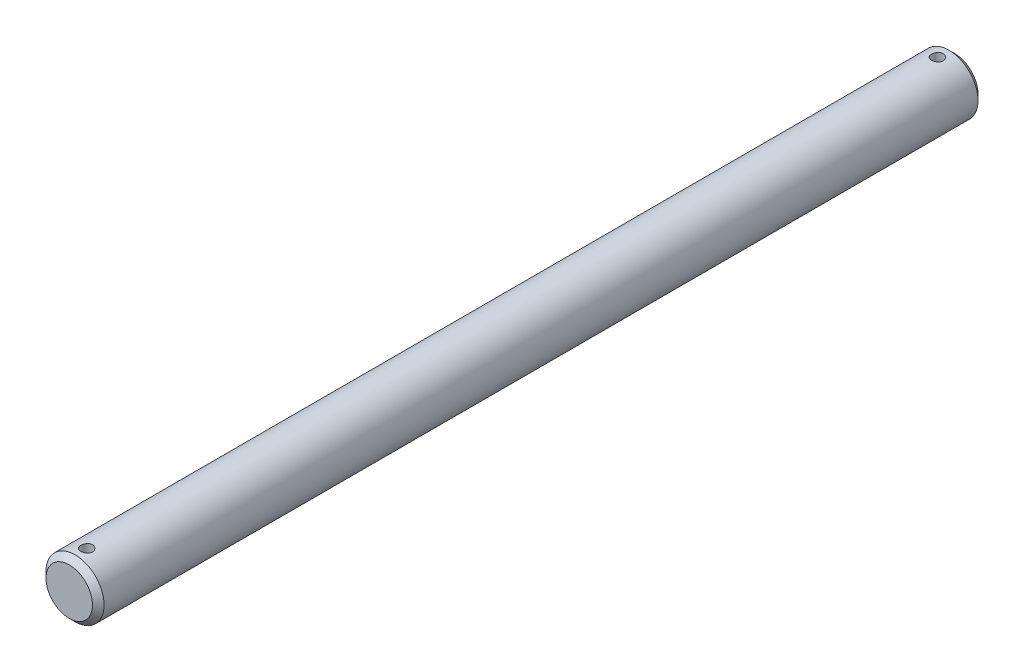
ISO-10303-21;
HEADER;
FILE_DESCRIPTION(('STEP AP214'),'2;1');
FILE_NAME('part.step','',(''),(''),'','','');
FILE_SCHEMA(('AUTOMOTIVE_DESIGN { 1 0 10303 214 1 1 1 1 }'));
ENDSEC;
DATA;
#1=APPLICATION_CONTEXT('core data for automotive mechanical design processes');
#2=APPLICATION_PROTOCOL_DEFINITION('international standard','automotive_design',2000,#1);
#3=PRODUCT_CONTEXT('',#1,'mechanical');
#4=PRODUCT('Part','Part','',(#3));
#5=PRODUCT_RELATED_PRODUCT_CATEGORY('part','',(#4));
#6=PRODUCT_DEFINITION_FORMATION('','',#4);
#7=PRODUCT_DEFINITION_CONTEXT('part definition',#1,'design');
#8=PRODUCT_DEFINITION('design','',#6,#7);
#9=PRODUCT_DEFINITION_SHAPE('','',#8);
#10=(LENGTH_UNIT() NAMED_UNIT(*) SI_UNIT(.MILLI.,.METRE.));
#11=(NAMED_UNIT(*) PLANE_ANGLE_UNIT() SI_UNIT($,.RADIAN.));
#12=(NAMED_UNIT(*) SI_UNIT($,.STERADIAN.) SOLID_ANGLE_UNIT());
#13=UNCERTAINTY_MEASURE_WITH_UNIT(LENGTH_MEASURE(1.E-05),#10,'distance_accuracy_value','');
#14=(GEOMETRIC_REPRESENTATION_CONTEXT(3) GLOBAL_UNCERTAINTY_ASSIGNED_CONTEXT((#13)) GLOBAL_UNIT_ASSIGNED_CONTEXT((#10,
#11,#12)) REPRESENTATION_CONTEXT('',''));
#15=CARTESIAN_POINT('',(0.,0.,0.));
#16=DIRECTION('',(0.,0.,1.));
#17=DIRECTION('',(1.,0.,0.));
#18=AXIS2_PLACEMENT_3D('',#15,#16,#17);
#19=CARTESIAN_POINT('',(0.,0.,305.));
#20=DIRECTION('',(0.,0.,-1.));
#21=DIRECTION('',(-1.,0.,0.));
#22=AXIS2_PLACEMENT_3D('',#19,#20,#21);
#23=CYLINDRICAL_SURFACE('',#22,10.);
#24=CARTESIAN_POINT('',(0.,0.,303.));
#25=DIRECTION('',(0.,0.,1.));
#26=DIRECTION('',(1.,0.,0.));
#27=AXIS2_PLACEMENT_3D('',#24,#25,#26);
#28=CIRCLE('',#27,10.);
#29=CARTESIAN_POINT('',(10.,0.,303.));
#30=VERTEX_POINT('',#29);
#31=EDGE_CURVE('E38',#30,#30,#28,.F.);
#32=ORIENTED_EDGE('',*,*,#31,.T.);
#33=EDGE_LOOP('',(#32));
#34=FACE_BOUND('',#33,.T.);
#35=CARTESIAN_POINT('',(0.,0.,2.));
#36=DIRECTION('',(0.,0.,1.));
#37=DIRECTION('',(1.,0.,0.));
#38=AXIS2_PLACEMENT_3D('',#35,#36,#37);
#39=CIRCLE('',#38,10.);
#40=CARTESIAN_POINT('',(10.,0.,2.));
#41=VERTEX_POINT('',#40);
#42=EDGE_CURVE('E44',#41,#41,#39,.T.);
#43=ORIENTED_EDGE('',*,*,#42,.T.);
#44=EDGE_LOOP('',(#43));
#45=FACE_BOUND('',#44,.T.);
#46=CARTESIAN_POINT('',(0.,-10.,297.));
#47=CARTESIAN_POINT('',(0.111153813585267,-9.99999795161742,297.000004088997));
#48=CARTESIAN_POINT('',(0.222359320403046,-9.99812770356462,297.009297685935));
#49=CARTESIAN_POINT('',(0.441627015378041,-9.99084731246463,297.046197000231));
#50=CARTESIAN_POINT('',(0.549686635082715,-9.98543435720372,297.073817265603));
#51=CARTESIAN_POINT('',(0.759460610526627,-9.97167298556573,297.146482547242));
#52=CARTESIAN_POINT('',(0.861180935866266,-9.96332738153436,297.191510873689));
#53=CARTESIAN_POINT('',(1.05561597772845,-9.94460796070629,297.297664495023));
#54=CARTESIAN_POINT('',(1.14833123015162,-9.93423426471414,297.358788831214));
#55=CARTESIAN_POINT('',(1.32338695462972,-9.9124433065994,297.496276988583));
#56=CARTESIAN_POINT('',(1.40558790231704,-9.90101491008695,297.572816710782));
#57=CARTESIAN_POINT('',(1.55607351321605,-9.87848360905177,297.738584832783));
#58=CARTESIAN_POINT('',(1.62435708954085,-9.86738073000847,297.82781422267));
#59=CARTESIAN_POINT('',(1.74566350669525,-9.8466488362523,298.017432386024));
#60=CARTESIAN_POINT('',(1.79854187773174,-9.83703414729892,298.117915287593));
#61=CARTESIAN_POINT('',(1.88661133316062,-9.82052536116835,298.326563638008));
#62=CARTESIAN_POINT('',(1.92180416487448,-9.81363099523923,298.434728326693));
#63=CARTESIAN_POINT('',(1.97305059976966,-9.80345610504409,298.654168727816));
#64=CARTESIAN_POINT('',(1.98934899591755,-9.80012940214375,298.765385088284));
#65=CARTESIAN_POINT('',(2.00310425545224,-9.79732750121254,298.989019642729));
#66=CARTESIAN_POINT('',(2.000563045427,-9.79785190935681,299.10143771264));
#67=CARTESIAN_POINT('',(1.97690914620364,-9.80265102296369,299.322493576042));
#68=CARTESIAN_POINT('',(1.95607708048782,-9.80686905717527,299.431162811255));
#69=CARTESIAN_POINT('',(1.8968757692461,-9.81849092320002,299.643432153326));
#70=CARTESIAN_POINT('',(1.85850568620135,-9.82589490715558,299.747032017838));
#71=CARTESIAN_POINT('',(1.76504956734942,-9.84311237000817,299.947030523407));
#72=CARTESIAN_POINT('',(1.7098523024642,-9.85294179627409,300.043375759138));
#73=CARTESIAN_POINT('',(1.58438714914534,-9.87389237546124,300.225541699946));
#74=CARTESIAN_POINT('',(1.51411752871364,-9.88501367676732,300.311361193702));
#75=CARTESIAN_POINT('',(1.35899986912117,-9.90754042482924,300.471658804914));
#76=CARTESIAN_POINT('',(1.27391232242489,-9.91894738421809,300.545905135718));
#77=CARTESIAN_POINT('',(1.09237004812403,-9.94057697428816,300.679107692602));
#78=CARTESIAN_POINT('',(0.995915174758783,-9.95079958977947,300.738063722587));
#79=CARTESIAN_POINT('',(0.794118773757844,-9.96893380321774,300.839055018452));
#80=CARTESIAN_POINT('',(0.688763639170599,-9.97684177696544,300.881063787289));
#81=CARTESIAN_POINT('',(0.472297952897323,-9.98942817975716,300.946720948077));
#82=CARTESIAN_POINT('',(0.36118810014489,-9.99410700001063,300.970371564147));
#83=CARTESIAN_POINT('',(0.138358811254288,-9.99965343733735,300.998312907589));
#84=CARTESIAN_POINT('',(0.0266806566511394,-10.0005834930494,301.002920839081));
#85=CARTESIAN_POINT('',(-0.195849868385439,-9.99870103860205,300.993500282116));
#86=CARTESIAN_POINT('',(-0.306702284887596,-9.99588873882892,300.979472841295));
#87=CARTESIAN_POINT('',(-0.523411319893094,-9.98687664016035,300.933443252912));
#88=CARTESIAN_POINT('',(-0.629303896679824,-9.98070752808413,300.901603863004));
#89=CARTESIAN_POINT('',(-0.834247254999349,-9.96567104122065,300.821032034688));
#90=CARTESIAN_POINT('',(-0.933297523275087,-9.95680346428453,300.772298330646));
#91=CARTESIAN_POINT('',(-1.12308234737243,-9.93719823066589,300.658635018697));
#92=CARTESIAN_POINT('',(-1.21370025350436,-9.92643900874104,300.593514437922));
#93=CARTESIAN_POINT('',(-1.3828360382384,-9.90429469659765,300.449181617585));
#94=CARTESIAN_POINT('',(-1.46135261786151,-9.89290953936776,300.3699678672));
#95=CARTESIAN_POINT('',(-1.60528118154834,-9.8705860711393,300.198253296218));
#96=CARTESIAN_POINT('',(-1.67047540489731,-9.85965720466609,300.105568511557));
#97=CARTESIAN_POINT('',(-1.78437084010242,-9.83968383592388,299.910377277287));
#98=CARTESIAN_POINT('',(-1.83307271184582,-9.83063925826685,299.807871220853));
#99=CARTESIAN_POINT('',(-1.91230368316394,-9.81553481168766,299.596463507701));
#100=CARTESIAN_POINT('',(-1.94292699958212,-9.80945949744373,299.487598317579));
#101=CARTESIAN_POINT('',(-1.9854173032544,-9.8009487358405,299.266133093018));
#102=CARTESIAN_POINT('',(-1.99728673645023,-9.79851281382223,299.153533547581));
#103=CARTESIAN_POINT('',(-2.00184182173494,-9.79758299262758,298.929982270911));
#104=CARTESIAN_POINT('',(-1.99487157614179,-9.79901838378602,298.819037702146));
#105=CARTESIAN_POINT('',(-1.96270460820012,-9.80551146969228,298.59993670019));
#106=CARTESIAN_POINT('',(-1.9375080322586,-9.81056913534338,298.49178024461));
#107=CARTESIAN_POINT('',(-1.86975713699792,-9.82370528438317,298.281544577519));
#108=CARTESIAN_POINT('',(-1.82724501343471,-9.83177642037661,298.179451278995));
#109=CARTESIAN_POINT('',(-1.72610928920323,-9.8500342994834,297.983792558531));
#110=CARTESIAN_POINT('',(-1.66748433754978,-9.86022121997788,297.89022785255));
#111=CARTESIAN_POINT('',(-1.53461182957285,-9.8817792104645,297.712568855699));
#112=CARTESIAN_POINT('',(-1.46011577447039,-9.89316745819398,297.628662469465));
#113=CARTESIAN_POINT('',(-1.29812873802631,-9.91572163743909,297.474427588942));
#114=CARTESIAN_POINT('',(-1.21063477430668,-9.92688751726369,297.404102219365));
#115=CARTESIAN_POINT('',(-1.02403525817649,-9.94787664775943,297.278330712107));
#116=CARTESIAN_POINT('',(-0.924817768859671,-9.95768462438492,297.22304799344));
#117=CARTESIAN_POINT('',(-0.718332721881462,-9.9747025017,297.130027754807));
#118=CARTESIAN_POINT('',(-0.611072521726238,-9.98191474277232,297.092274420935));
#119=CARTESIAN_POINT('',(-0.419642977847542,-9.99152745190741,297.042696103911));
#120=CARTESIAN_POINT('',(-0.33656332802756,-9.99468606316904,297.026713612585));
#121=CARTESIAN_POINT('',(-0.168999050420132,-9.99892308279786,297.005364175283));
#122=CARTESIAN_POINT('',(-0.0845144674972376,-10.0000015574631,296.99999689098));
#123=CARTESIAN_POINT('',(0.,-10.,297.));
#124=B_SPLINE_CURVE_WITH_KNOTS('',3,(#46,#47,#48,#49,#50,#51,#52,#53,#54,#55,#56,#57,#58,#59,
#60,#61,#62,#63,#64,#65,#66,#67,#68,#69,#70,#71,#72,#73,#74,#75,#76,#77,#78,#79,#80,#81,#82,#83,
#84,#85,#86,#87,#88,#89,#90,#91,#92,#93,#94,#95,#96,#97,#98,#99,#100,#101,#102,#103,#104,#105,
#106,#107,#108,#109,#110,#111,#112,#113,#114,#115,#116,#117,#118,#119,#120,#121,#122,#123),
.UNSPECIFIED.,.T.,.F.,(4,2,2,2,2,2,2,2,2,2,2,2,2,2,2,2,2,2,2,2,2,2,2,2,2,2,2,2,2,2,2,2,2,2,2,2,
2,2,4),(0.,0.333152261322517,0.666569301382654,0.999667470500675,1.33274580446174,
1.66986534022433,2.00701119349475,2.3472239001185,2.68740298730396,3.02312370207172,
3.35881008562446,3.68943454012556,4.02007478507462,4.35294980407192,4.68586309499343,
5.02476504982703,5.36367135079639,5.70310549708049,6.04249851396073,6.37621471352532,
6.70991215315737,7.04060907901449,7.37133078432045,7.70610132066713,8.04090776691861,
8.38081257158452,8.7207037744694,9.05880762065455,9.39686736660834,9.72879445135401,
10.0607188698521,10.3918392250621,10.7229873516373,11.0597615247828,11.3966130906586,
11.7369899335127,12.0770591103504,12.3303755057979,12.5836838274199),.UNSPECIFIED.);
#125=CARTESIAN_POINT('',(0.,-10.,297.));
#126=VERTEX_POINT('',#125);
#127=EDGE_CURVE('E56',#126,#126,#124,.T.);
#128=ORIENTED_EDGE('',*,*,#127,.F.);
#129=EDGE_LOOP('',(#128));
#130=FACE_BOUND('',#129,.T.);
#131=CARTESIAN_POINT('',(0.,10.,4.));
#132=CARTESIAN_POINT('',(-0.111153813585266,9.99999795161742,4.00000408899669));
#133=CARTESIAN_POINT('',(-0.222359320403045,9.99812770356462,4.00929768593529));
#134=CARTESIAN_POINT('',(-0.441627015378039,9.99084731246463,4.04619700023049));
#135=CARTESIAN_POINT('',(-0.549686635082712,9.98543435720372,4.07381726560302));
#136=CARTESIAN_POINT('',(-0.759460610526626,9.97167298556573,4.14648254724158));
#137=CARTESIAN_POINT('',(-0.861180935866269,9.96332738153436,4.19151087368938));
#138=CARTESIAN_POINT('',(-1.05561597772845,9.94460796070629,4.29766449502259));
#139=CARTESIAN_POINT('',(-1.14833123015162,9.93423426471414,4.35878883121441));
#140=CARTESIAN_POINT('',(-1.32338695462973,9.9124433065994,4.49627698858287));
#141=CARTESIAN_POINT('',(-1.40558790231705,9.90101491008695,4.57281671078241));
#142=CARTESIAN_POINT('',(-1.55607351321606,9.87848360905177,4.73858483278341));
#143=CARTESIAN_POINT('',(-1.62435708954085,9.86738073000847,4.82781422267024));
#144=CARTESIAN_POINT('',(-1.74566350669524,9.8466488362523,5.01743238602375));
#145=CARTESIAN_POINT('',(-1.79854187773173,9.83703414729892,5.11791528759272));
#146=CARTESIAN_POINT('',(-1.88661133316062,9.82052536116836,5.32656363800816));
#147=CARTESIAN_POINT('',(-1.92180416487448,9.81363099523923,5.43472832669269));
#148=CARTESIAN_POINT('',(-1.97305059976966,9.80345610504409,5.65416872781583));
#149=CARTESIAN_POINT('',(-1.98934899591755,9.80012940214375,5.76538508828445));
#150=CARTESIAN_POINT('',(-2.00310425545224,9.79732750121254,5.98901964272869));
#151=CARTESIAN_POINT('',(-2.000563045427,9.79785190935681,6.10143771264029));
#152=CARTESIAN_POINT('',(-1.97690914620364,9.80265102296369,6.32249357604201));
#153=CARTESIAN_POINT('',(-1.95607708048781,9.80686905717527,6.43116281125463));
#154=CARTESIAN_POINT('',(-1.8968757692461,9.81849092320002,6.643432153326));
#155=CARTESIAN_POINT('',(-1.85850568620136,9.82589490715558,6.74703201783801));
#156=CARTESIAN_POINT('',(-1.76504956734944,9.84311237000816,6.9470305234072));
#157=CARTESIAN_POINT('',(-1.70985230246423,9.85294179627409,7.04337575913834));
#158=CARTESIAN_POINT('',(-1.58438714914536,9.87389237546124,7.22554169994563));
#159=CARTESIAN_POINT('',(-1.51411752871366,9.88501367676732,7.31136119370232));
#160=CARTESIAN_POINT('',(-1.35899986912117,9.90754042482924,7.47165880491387));
#161=CARTESIAN_POINT('',(-1.27391232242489,9.9189473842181,7.54590513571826));
#162=CARTESIAN_POINT('',(-1.09237004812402,9.94057697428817,7.67910769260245));
#163=CARTESIAN_POINT('',(-0.995915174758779,9.95079958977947,7.73806372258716));
#164=CARTESIAN_POINT('',(-0.794118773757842,9.96893380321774,7.83905501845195));
#165=CARTESIAN_POINT('',(-0.6887636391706,9.97684177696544,7.88106378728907));
#166=CARTESIAN_POINT('',(-0.47229795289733,9.98942817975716,7.94672094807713));
#167=CARTESIAN_POINT('',(-0.3611881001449,9.99410700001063,7.97037156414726));
#168=CARTESIAN_POINT('',(-0.138358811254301,9.99965343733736,7.99831290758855));
#169=CARTESIAN_POINT('',(-0.0266806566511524,10.0005834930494,8.00292083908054));
#170=CARTESIAN_POINT('',(0.195849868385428,9.99870103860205,7.99350028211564));
#171=CARTESIAN_POINT('',(0.306702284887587,9.99588873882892,7.97947284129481));
#172=CARTESIAN_POINT('',(0.523411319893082,9.98687664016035,7.93344325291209));
#173=CARTESIAN_POINT('',(0.629303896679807,9.98070752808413,7.90160386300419));
#174=CARTESIAN_POINT('',(0.834247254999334,9.96567104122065,7.82103203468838));
#175=CARTESIAN_POINT('',(0.933297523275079,9.95680346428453,7.77229833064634));
#176=CARTESIAN_POINT('',(1.12308234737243,9.93719823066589,7.65863501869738));
#177=CARTESIAN_POINT('',(1.21370025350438,9.92643900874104,7.59351443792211));
#178=CARTESIAN_POINT('',(1.38283603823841,9.90429469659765,7.44918161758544));
#179=CARTESIAN_POINT('',(1.46135261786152,9.89290953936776,7.36996786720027));
#180=CARTESIAN_POINT('',(1.60528118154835,9.8705860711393,7.19825329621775));
#181=CARTESIAN_POINT('',(1.67047540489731,9.85965720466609,7.10556851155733));
#182=CARTESIAN_POINT('',(1.78437084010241,9.83968383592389,6.91037727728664));
#183=CARTESIAN_POINT('',(1.83307271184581,9.83063925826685,6.8078712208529));
#184=CARTESIAN_POINT('',(1.91230368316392,9.81553481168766,6.5964635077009));
#185=CARTESIAN_POINT('',(1.9429269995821,9.80945949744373,6.48759831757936));
#186=CARTESIAN_POINT('',(1.98541730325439,9.8009487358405,6.26613309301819));
#187=CARTESIAN_POINT('',(1.99728673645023,9.79851281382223,6.15353354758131));
#188=CARTESIAN_POINT('',(2.00184182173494,9.79758299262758,5.92998227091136));
#189=CARTESIAN_POINT('',(1.99487157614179,9.79901838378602,5.81903770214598));
#190=CARTESIAN_POINT('',(1.96270460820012,9.80551146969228,5.59993670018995));
#191=CARTESIAN_POINT('',(1.9375080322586,9.81056913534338,5.49178024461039));
#192=CARTESIAN_POINT('',(1.86975713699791,9.82370528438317,5.28154457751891));
#193=CARTESIAN_POINT('',(1.82724501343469,9.83177642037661,5.17945127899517));
#194=CARTESIAN_POINT('',(1.72610928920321,9.85003429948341,4.98379255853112));
#195=CARTESIAN_POINT('',(1.66748433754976,9.86022121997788,4.89022785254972));
#196=CARTESIAN_POINT('',(1.53461182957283,9.88177921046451,4.71256885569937));
#197=CARTESIAN_POINT('',(1.46011577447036,9.89316745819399,4.62866246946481));
#198=CARTESIAN_POINT('',(1.29812873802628,9.91572163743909,4.47442758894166));
#199=CARTESIAN_POINT('',(1.21063477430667,9.92688751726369,4.40410221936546));
#200=CARTESIAN_POINT('',(1.02403525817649,9.94787664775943,4.27833071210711));
#201=CARTESIAN_POINT('',(0.92481776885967,9.95768462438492,4.22304799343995));
#202=CARTESIAN_POINT('',(0.718332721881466,9.9747025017,4.13002775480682));
#203=CARTESIAN_POINT('',(0.611072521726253,9.98191474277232,4.09227442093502));
#204=CARTESIAN_POINT('',(0.419642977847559,9.99152745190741,4.04269610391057));
#205=CARTESIAN_POINT('',(0.33656332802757,9.99468606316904,4.02671361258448));
#206=CARTESIAN_POINT('',(0.168999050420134,9.99892308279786,4.00536417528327));
#207=CARTESIAN_POINT('',(0.0845144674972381,10.0000015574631,3.99999689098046));
#208=CARTESIAN_POINT('',(0.,10.,4.));
#209=B_SPLINE_CURVE_WITH_KNOTS('',3,(#131,#132,#133,#134,#135,#136,#137,#138,#139,#140,#141,
#142,#143,#144,#145,#146,#147,#148,#149,#150,#151,#152,#153,#154,#155,#156,#157,#158,#159,#160,
#161,#162,#163,#164,#165,#166,#167,#168,#169,#170,#171,#172,#173,#174,#175,#176,#177,#178,#179,
#180,#181,#182,#183,#184,#185,#186,#187,#188,#189,#190,#191,#192,#193,#194,#195,#196,#197,#198,
#199,#200,#201,#202,#203,#204,#205,#206,#207,#208),.UNSPECIFIED.,.T.,.F.,(4,2,2,2,2,2,2,2,2,2,2,
2,2,2,2,2,2,2,2,2,2,2,2,2,2,2,2,2,2,2,2,2,2,2,2,2,2,2,4),(0.,0.333152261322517,
0.666569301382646,0.999667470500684,1.33274580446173,1.66986534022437,2.00701119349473,
2.34722390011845,2.68740298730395,3.02312370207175,3.3588100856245,3.68943454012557,
4.02007478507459,4.35294980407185,4.68586309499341,5.02476504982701,5.3636713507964,
5.70310549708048,6.04249851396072,6.3762147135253,6.70991215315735,7.04060907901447,
7.37133078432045,7.70610132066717,8.0409077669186,8.38081257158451,8.72070377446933,
9.05880762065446,9.39686736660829,9.72879445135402,10.0607188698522,10.3918392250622,
10.7229873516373,11.0597615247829,11.3966130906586,11.7369899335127,12.0770591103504,
12.3303755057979,12.5836838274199),.UNSPECIFIED.);
#210=CARTESIAN_POINT('',(0.,10.,4.));
#211=VERTEX_POINT('',#210);
#212=EDGE_CURVE('E65',#211,#211,#209,.T.);
#213=ORIENTED_EDGE('',*,*,#212,.F.);
#214=EDGE_LOOP('',(#213));
#215=FACE_BOUND('',#214,.T.);
#216=CARTESIAN_POINT('',(0.,-10.,4.));
#217=CARTESIAN_POINT('',(0.111153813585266,-9.99999795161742,4.00000408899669));
#218=CARTESIAN_POINT('',(0.222359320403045,-9.99812770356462,4.00929768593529));
#219=CARTESIAN_POINT('',(0.441627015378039,-9.99084731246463,4.04619700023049));
#220=CARTESIAN_POINT('',(0.549686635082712,-9.98543435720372,4.07381726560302));
#221=CARTESIAN_POINT('',(0.759460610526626,-9.97167298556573,4.14648254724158));
#222=CARTESIAN_POINT('',(0.861180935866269,-9.96332738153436,4.19151087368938));
#223=CARTESIAN_POINT('',(1.05561597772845,-9.94460796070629,4.29766449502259));
#224=CARTESIAN_POINT('',(1.14833123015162,-9.93423426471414,4.35878883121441));
#225=CARTESIAN_POINT('',(1.32338695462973,-9.9124433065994,4.49627698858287));
#226=CARTESIAN_POINT('',(1.40558790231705,-9.90101491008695,4.57281671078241));
#227=CARTESIAN_POINT('',(1.55607351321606,-9.87848360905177,4.73858483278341));
#228=CARTESIAN_POINT('',(1.62435708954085,-9.86738073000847,4.82781422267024));
#229=CARTESIAN_POINT('',(1.74566350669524,-9.8466488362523,5.01743238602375));
#230=CARTESIAN_POINT('',(1.79854187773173,-9.83703414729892,5.11791528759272));
#231=CARTESIAN_POINT('',(1.88661133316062,-9.82052536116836,5.32656363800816));
#232=CARTESIAN_POINT('',(1.92180416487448,-9.81363099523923,5.43472832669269));
#233=CARTESIAN_POINT('',(1.97305059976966,-9.80345610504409,5.65416872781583));
#234=CARTESIAN_POINT('',(1.98934899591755,-9.80012940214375,5.76538508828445));
#235=CARTESIAN_POINT('',(2.00310425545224,-9.79732750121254,5.98901964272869));
#236=CARTESIAN_POINT('',(2.000563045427,-9.79785190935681,6.10143771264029));
#237=CARTESIAN_POINT('',(1.97690914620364,-9.80265102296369,6.32249357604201));
#238=CARTESIAN_POINT('',(1.95607708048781,-9.80686905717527,6.43116281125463));
#239=CARTESIAN_POINT('',(1.8968757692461,-9.81849092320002,6.643432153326));
#240=CARTESIAN_POINT('',(1.85850568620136,-9.82589490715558,6.74703201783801));
#241=CARTESIAN_POINT('',(1.76504956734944,-9.84311237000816,6.9470305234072));
#242=CARTESIAN_POINT('',(1.70985230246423,-9.85294179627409,7.04337575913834));
#243=CARTESIAN_POINT('',(1.58438714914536,-9.87389237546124,7.22554169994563));
#244=CARTESIAN_POINT('',(1.51411752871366,-9.88501367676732,7.31136119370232));
#245=CARTESIAN_POINT('',(1.35899986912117,-9.90754042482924,7.47165880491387));
#246=CARTESIAN_POINT('',(1.27391232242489,-9.9189473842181,7.54590513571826));
#247=CARTESIAN_POINT('',(1.09237004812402,-9.94057697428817,7.67910769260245));
#248=CARTESIAN_POINT('',(0.995915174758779,-9.95079958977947,7.73806372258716));
#249=CARTESIAN_POINT('',(0.794118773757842,-9.96893380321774,7.83905501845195));
#250=CARTESIAN_POINT('',(0.6887636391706,-9.97684177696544,7.88106378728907));
#251=CARTESIAN_POINT('',(0.47229795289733,-9.98942817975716,7.94672094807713));
#252=CARTESIAN_POINT('',(0.3611881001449,-9.99410700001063,7.97037156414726));
#253=CARTESIAN_POINT('',(0.138358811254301,-9.99965343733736,7.99831290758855));
#254=CARTESIAN_POINT('',(0.0266806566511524,-10.0005834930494,8.00292083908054));
#255=CARTESIAN_POINT('',(-0.195849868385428,-9.99870103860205,7.99350028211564));
#256=CARTESIAN_POINT('',(-0.306702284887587,-9.99588873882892,7.97947284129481));
#257=CARTESIAN_POINT('',(-0.523411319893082,-9.98687664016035,7.93344325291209));
#258=CARTESIAN_POINT('',(-0.629303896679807,-9.98070752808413,7.90160386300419));
#259=CARTESIAN_POINT('',(-0.834247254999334,-9.96567104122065,7.82103203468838));
#260=CARTESIAN_POINT('',(-0.933297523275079,-9.95680346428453,7.77229833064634));
#261=CARTESIAN_POINT('',(-1.12308234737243,-9.93719823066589,7.65863501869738));
#262=CARTESIAN_POINT('',(-1.21370025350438,-9.92643900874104,7.59351443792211));
#263=CARTESIAN_POINT('',(-1.38283603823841,-9.90429469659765,7.44918161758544));
#264=CARTESIAN_POINT('',(-1.46135261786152,-9.89290953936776,7.36996786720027));
#265=CARTESIAN_POINT('',(-1.60528118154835,-9.8705860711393,7.19825329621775));
#266=CARTESIAN_POINT('',(-1.67047540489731,-9.85965720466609,7.10556851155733));
#267=CARTESIAN_POINT('',(-1.78437084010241,-9.83968383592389,6.91037727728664));
#268=CARTESIAN_POINT('',(-1.83307271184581,-9.83063925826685,6.8078712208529));
#269=CARTESIAN_POINT('',(-1.91230368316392,-9.81553481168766,6.5964635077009));
#270=CARTESIAN_POINT('',(-1.9429269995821,-9.80945949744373,6.48759831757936));
#271=CARTESIAN_POINT('',(-1.98541730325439,-9.8009487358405,6.26613309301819));
#272=CARTESIAN_POINT('',(-1.99728673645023,-9.79851281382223,6.15353354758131));
#273=CARTESIAN_POINT('',(-2.00184182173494,-9.79758299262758,5.92998227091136));
#274=CARTESIAN_POINT('',(-1.99487157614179,-9.79901838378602,5.81903770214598));
#275=CARTESIAN_POINT('',(-1.96270460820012,-9.80551146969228,5.59993670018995));
#276=CARTESIAN_POINT('',(-1.9375080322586,-9.81056913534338,5.49178024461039));
#277=CARTESIAN_POINT('',(-1.86975713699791,-9.82370528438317,5.28154457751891));
#278=CARTESIAN_POINT('',(-1.82724501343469,-9.83177642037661,5.17945127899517));
#279=CARTESIAN_POINT('',(-1.72610928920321,-9.85003429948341,4.98379255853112));
#280=CARTESIAN_POINT('',(-1.66748433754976,-9.86022121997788,4.89022785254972));
#281=CARTESIAN_POINT('',(-1.53461182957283,-9.88177921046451,4.71256885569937));
#282=CARTESIAN_POINT('',(-1.46011577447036,-9.89316745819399,4.62866246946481));
#283=CARTESIAN_POINT('',(-1.29812873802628,-9.91572163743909,4.47442758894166));
#284=CARTESIAN_POINT('',(-1.21063477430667,-9.92688751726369,4.40410221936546));
#285=CARTESIAN_POINT('',(-1.02403525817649,-9.94787664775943,4.27833071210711));
#286=CARTESIAN_POINT('',(-0.92481776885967,-9.95768462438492,4.22304799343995));
#287=CARTESIAN_POINT('',(-0.718332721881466,-9.9747025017,4.13002775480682));
#288=CARTESIAN_POINT('',(-0.611072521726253,-9.98191474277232,4.09227442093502));
#289=CARTESIAN_POINT('',(-0.419642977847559,-9.99152745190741,4.04269610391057));
#290=CARTESIAN_POINT('',(-0.33656332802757,-9.99468606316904,4.02671361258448));
#291=CARTESIAN_POINT('',(-0.168999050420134,-9.99892308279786,4.00536417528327));
#292=CARTESIAN_POINT('',(-0.0845144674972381,-10.0000015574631,3.99999689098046));
#293=CARTESIAN_POINT('',(0.,-10.,4.));
#294=B_SPLINE_CURVE_WITH_KNOTS('',3,(#216,#217,#218,#219,#220,#221,#222,#223,#224,#225,#226,
#227,#228,#229,#230,#231,#232,#233,#234,#235,#236,#237,#238,#239,#240,#241,#242,#243,#244,#245,
#246,#247,#248,#249,#250,#251,#252,#253,#254,#255,#256,#257,#258,#259,#260,#261,#262,#263,#264,
#265,#266,#267,#268,#269,#270,#271,#272,#273,#274,#275,#276,#277,#278,#279,#280,#281,#282,#283,
#284,#285,#286,#287,#288,#289,#290,#291,#292,#293),.UNSPECIFIED.,.T.,.F.,(4,2,2,2,2,2,2,2,2,2,2,
2,2,2,2,2,2,2,2,2,2,2,2,2,2,2,2,2,2,2,2,2,2,2,2,2,2,2,4),(0.,0.333152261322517,
0.666569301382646,0.999667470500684,1.33274580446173,1.66986534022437,2.00701119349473,
2.34722390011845,2.68740298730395,3.02312370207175,3.3588100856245,3.68943454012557,
4.02007478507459,4.35294980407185,4.68586309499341,5.02476504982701,5.3636713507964,
5.70310549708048,6.04249851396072,6.3762147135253,6.70991215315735,7.04060907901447,
7.37133078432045,7.70610132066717,8.0409077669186,8.38081257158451,8.72070377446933,
9.05880762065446,9.39686736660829,9.72879445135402,10.0607188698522,10.3918392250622,
10.7229873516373,11.0597615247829,11.3966130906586,11.7369899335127,12.0770591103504,
12.3303755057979,12.5836838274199),.UNSPECIFIED.);
#295=CARTESIAN_POINT('',(0.,-10.,4.));
#296=VERTEX_POINT('',#295);
#297=EDGE_CURVE('E87',#296,#296,#294,.T.);
#298=ORIENTED_EDGE('',*,*,#297,.F.);
#299=EDGE_LOOP('',(#298));
#300=FACE_BOUND('',#299,.T.);
#301=CARTESIAN_POINT('',(0.,10.,297.));
#302=CARTESIAN_POINT('',(-0.111153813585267,9.99999795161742,297.000004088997));
#303=CARTESIAN_POINT('',(-0.222359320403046,9.99812770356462,297.009297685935));
#304=CARTESIAN_POINT('',(-0.441627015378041,9.99084731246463,297.046197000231));
#305=CARTESIAN_POINT('',(-0.549686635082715,9.98543435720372,297.073817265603));
#306=CARTESIAN_POINT('',(-0.759460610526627,9.97167298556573,297.146482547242));
#307=CARTESIAN_POINT('',(-0.861180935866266,9.96332738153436,297.191510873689));
#308=CARTESIAN_POINT('',(-1.05561597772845,9.94460796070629,297.297664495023));
#309=CARTESIAN_POINT('',(-1.14833123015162,9.93423426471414,297.358788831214));
#310=CARTESIAN_POINT('',(-1.32338695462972,9.9124433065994,297.496276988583));
#311=CARTESIAN_POINT('',(-1.40558790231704,9.90101491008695,297.572816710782));
#312=CARTESIAN_POINT('',(-1.55607351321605,9.87848360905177,297.738584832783));
#313=CARTESIAN_POINT('',(-1.62435708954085,9.86738073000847,297.82781422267));
#314=CARTESIAN_POINT('',(-1.74566350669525,9.8466488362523,298.017432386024));
#315=CARTESIAN_POINT('',(-1.79854187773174,9.83703414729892,298.117915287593));
#316=CARTESIAN_POINT('',(-1.88661133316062,9.82052536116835,298.326563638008));
#317=CARTESIAN_POINT('',(-1.92180416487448,9.81363099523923,298.434728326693));
#318=CARTESIAN_POINT('',(-1.97305059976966,9.80345610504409,298.654168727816));
#319=CARTESIAN_POINT('',(-1.98934899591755,9.80012940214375,298.765385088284));
#320=CARTESIAN_POINT('',(-2.00310425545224,9.79732750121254,298.989019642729));
#321=CARTESIAN_POINT('',(-2.000563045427,9.79785190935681,299.10143771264));
#322=CARTESIAN_POINT('',(-1.97690914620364,9.80265102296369,299.322493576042));
#323=CARTESIAN_POINT('',(-1.95607708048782,9.80686905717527,299.431162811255));
#324=CARTESIAN_POINT('',(-1.8968757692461,9.81849092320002,299.643432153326));
#325=CARTESIAN_POINT('',(-1.85850568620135,9.82589490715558,299.747032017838));
#326=CARTESIAN_POINT('',(-1.76504956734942,9.84311237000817,299.947030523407));
#327=CARTESIAN_POINT('',(-1.7098523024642,9.85294179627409,300.043375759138));
#328=CARTESIAN_POINT('',(-1.58438714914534,9.87389237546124,300.225541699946));
#329=CARTESIAN_POINT('',(-1.51411752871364,9.88501367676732,300.311361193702));
#330=CARTESIAN_POINT('',(-1.35899986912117,9.90754042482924,300.471658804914));
#331=CARTESIAN_POINT('',(-1.27391232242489,9.91894738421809,300.545905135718));
#332=CARTESIAN_POINT('',(-1.09237004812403,9.94057697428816,300.679107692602));
#333=CARTESIAN_POINT('',(-0.995915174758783,9.95079958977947,300.738063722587));
#334=CARTESIAN_POINT('',(-0.794118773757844,9.96893380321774,300.839055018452));
#335=CARTESIAN_POINT('',(-0.688763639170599,9.97684177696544,300.881063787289));
#336=CARTESIAN_POINT('',(-0.472297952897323,9.98942817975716,300.946720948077));
#337=CARTESIAN_POINT('',(-0.36118810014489,9.99410700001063,300.970371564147));
#338=CARTESIAN_POINT('',(-0.138358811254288,9.99965343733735,300.998312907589));
#339=CARTESIAN_POINT('',(-0.0266806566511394,10.0005834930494,301.002920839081));
#340=CARTESIAN_POINT('',(0.195849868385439,9.99870103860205,300.993500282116));
#341=CARTESIAN_POINT('',(0.306702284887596,9.99588873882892,300.979472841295));
#342=CARTESIAN_POINT('',(0.523411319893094,9.98687664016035,300.933443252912));
#343=CARTESIAN_POINT('',(0.629303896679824,9.98070752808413,300.901603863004));
#344=CARTESIAN_POINT('',(0.834247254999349,9.96567104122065,300.821032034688));
#345=CARTESIAN_POINT('',(0.933297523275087,9.95680346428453,300.772298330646));
#346=CARTESIAN_POINT('',(1.12308234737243,9.93719823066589,300.658635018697));
#347=CARTESIAN_POINT('',(1.21370025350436,9.92643900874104,300.593514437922));
#348=CARTESIAN_POINT('',(1.3828360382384,9.90429469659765,300.449181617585));
#349=CARTESIAN_POINT('',(1.46135261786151,9.89290953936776,300.3699678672));
#350=CARTESIAN_POINT('',(1.60528118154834,9.8705860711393,300.198253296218));
#351=CARTESIAN_POINT('',(1.67047540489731,9.85965720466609,300.105568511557));
#352=CARTESIAN_POINT('',(1.78437084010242,9.83968383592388,299.910377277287));
#353=CARTESIAN_POINT('',(1.83307271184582,9.83063925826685,299.807871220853));
#354=CARTESIAN_POINT('',(1.91230368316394,9.81553481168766,299.596463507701));
#355=CARTESIAN_POINT('',(1.94292699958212,9.80945949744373,299.487598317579));
#356=CARTESIAN_POINT('',(1.9854173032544,9.8009487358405,299.266133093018));
#357=CARTESIAN_POINT('',(1.99728673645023,9.79851281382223,299.153533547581));
#358=CARTESIAN_POINT('',(2.00184182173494,9.79758299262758,298.929982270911));
#359=CARTESIAN_POINT('',(1.99487157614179,9.79901838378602,298.819037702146));
#360=CARTESIAN_POINT('',(1.96270460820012,9.80551146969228,298.59993670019));
#361=CARTESIAN_POINT('',(1.9375080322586,9.81056913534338,298.49178024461));
#362=CARTESIAN_POINT('',(1.86975713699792,9.82370528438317,298.281544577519));
#363=CARTESIAN_POINT('',(1.82724501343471,9.83177642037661,298.179451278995));
#364=CARTESIAN_POINT('',(1.72610928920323,9.8500342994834,297.983792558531));
#365=CARTESIAN_POINT('',(1.66748433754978,9.86022121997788,297.89022785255));
#366=CARTESIAN_POINT('',(1.53461182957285,9.8817792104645,297.712568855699));
#367=CARTESIAN_POINT('',(1.46011577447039,9.89316745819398,297.628662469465));
#368=CARTESIAN_POINT('',(1.29812873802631,9.91572163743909,297.474427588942));
#369=CARTESIAN_POINT('',(1.21063477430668,9.92688751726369,297.404102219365));
#370=CARTESIAN_POINT('',(1.02403525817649,9.94787664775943,297.278330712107));
#371=CARTESIAN_POINT('',(0.924817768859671,9.95768462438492,297.22304799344));
#372=CARTESIAN_POINT('',(0.718332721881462,9.9747025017,297.130027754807));
#373=CARTESIAN_POINT('',(0.611072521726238,9.98191474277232,297.092274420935));
#374=CARTESIAN_POINT('',(0.419642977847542,9.99152745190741,297.042696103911));
#375=CARTESIAN_POINT('',(0.33656332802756,9.99468606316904,297.026713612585));
#376=CARTESIAN_POINT('',(0.168999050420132,9.99892308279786,297.005364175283));
#377=CARTESIAN_POINT('',(0.0845144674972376,10.0000015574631,296.99999689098));
#378=CARTESIAN_POINT('',(0.,10.,297.));
#379=B_SPLINE_CURVE_WITH_KNOTS('',3,(#301,#302,#303,#304,#305,#306,#307,#308,#309,#310,#311,
#312,#313,#314,#315,#316,#317,#318,#319,#320,#321,#322,#323,#324,#325,#326,#327,#328,#329,#330,
#331,#332,#333,#334,#335,#336,#337,#338,#339,#340,#341,#342,#343,#344,#345,#346,#347,#348,#349,
#350,#351,#352,#353,#354,#355,#356,#357,#358,#359,#360,#361,#362,#363,#364,#365,#366,#367,#368,
#369,#370,#371,#372,#373,#374,#375,#376,#377,#378),.UNSPECIFIED.,.T.,.F.,(4,2,2,2,2,2,2,2,2,2,2,
2,2,2,2,2,2,2,2,2,2,2,2,2,2,2,2,2,2,2,2,2,2,2,2,2,2,2,4),(0.,0.333152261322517,
0.666569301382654,0.999667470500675,1.33274580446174,1.66986534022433,2.00701119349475,
2.3472239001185,2.68740298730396,3.02312370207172,3.35881008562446,3.68943454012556,
4.02007478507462,4.35294980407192,4.68586309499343,5.02476504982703,5.36367135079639,
5.70310549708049,6.04249851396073,6.37621471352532,6.70991215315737,7.04060907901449,
7.37133078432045,7.70610132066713,8.04090776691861,8.38081257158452,8.7207037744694,
9.05880762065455,9.39686736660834,9.72879445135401,10.0607188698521,10.3918392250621,
10.7229873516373,11.0597615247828,11.3966130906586,11.7369899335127,12.0770591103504,
12.3303755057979,12.5836838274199),.UNSPECIFIED.);
#380=CARTESIAN_POINT('',(0.,10.,297.));
#381=VERTEX_POINT('',#380);
#382=EDGE_CURVE('E57',#381,#381,#379,.T.);
#383=ORIENTED_EDGE('',*,*,#382,.F.);
#384=EDGE_LOOP('',(#383));
#385=FACE_BOUND('',#384,.T.);
#386=ADVANCED_FACE('F30',(#34,#45,#130,#215,#300,#385),#23,.T.);
#387=CARTESIAN_POINT('',(0.,0.,305.));
#388=DIRECTION('',(0.,0.,1.));
#389=DIRECTION('',(1.,0.,0.));
#390=AXIS2_PLACEMENT_3D('',#387,#388,#389);
#391=PLANE('',#390);
#392=CARTESIAN_POINT('',(0.,0.,305.));
#393=DIRECTION('',(0.,0.,1.));
#394=DIRECTION('',(1.,0.,0.));
#395=AXIS2_PLACEMENT_3D('',#392,#393,#394);
#396=CIRCLE('',#395,7.99999999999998);
#397=CARTESIAN_POINT('',(7.99999999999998,0.,305.));
#398=VERTEX_POINT('',#397);
#399=EDGE_CURVE('E50',#398,#398,#396,.T.);
#400=ORIENTED_EDGE('',*,*,#399,.T.);
#401=EDGE_LOOP('',(#400));
#402=FACE_BOUND('',#401,.T.);
#403=ADVANCED_FACE('F84',(#402),#391,.T.);
#404=CARTESIAN_POINT('',(0.,0.,0.));
#405=DIRECTION('',(0.,0.,1.));
#406=DIRECTION('',(1.,0.,0.));
#407=AXIS2_PLACEMENT_3D('',#404,#405,#406);
#408=PLANE('',#407);
#409=CARTESIAN_POINT('',(0.,0.,0.));
#410=DIRECTION('',(0.,0.,1.));
#411=DIRECTION('',(1.,0.,0.));
#412=AXIS2_PLACEMENT_3D('',#409,#410,#411);
#413=CIRCLE('',#412,7.99999999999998);
#414=CARTESIAN_POINT('',(7.99999999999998,0.,0.));
#415=VERTEX_POINT('',#414);
#416=EDGE_CURVE('E10',#415,#415,#413,.F.);
#417=ORIENTED_EDGE('',*,*,#416,.T.);
#418=EDGE_LOOP('',(#417));
#419=FACE_BOUND('',#418,.T.);
#420=ADVANCED_FACE('F82',(#419),#408,.F.);
#421=CARTESIAN_POINT('',(0.,300.,6.));
#422=DIRECTION('',(0.,-1.,0.));
#423=DIRECTION('',(0.,0.,-1.));
#424=AXIS2_PLACEMENT_3D('',#421,#422,#423);
#425=CYLINDRICAL_SURFACE('',#424,2.);
#426=ORIENTED_EDGE('',*,*,#297,.T.);
#427=EDGE_LOOP('',(#426));
#428=FACE_BOUND('',#427,.T.);
#429=ORIENTED_EDGE('',*,*,#212,.T.);
#430=EDGE_LOOP('',(#429));
#431=FACE_BOUND('',#430,.T.);
#432=ADVANCED_FACE('F76',(#428,#431),#425,.F.);
#433=CARTESIAN_POINT('',(0.,300.,299.));
#434=DIRECTION('',(0.,-1.,0.));
#435=DIRECTION('',(0.,0.,-1.));
#436=AXIS2_PLACEMENT_3D('',#433,#434,#435);
#437=CYLINDRICAL_SURFACE('',#436,2.);
#438=ORIENTED_EDGE('',*,*,#127,.T.);
#439=EDGE_LOOP('',(#438));
#440=FACE_BOUND('',#439,.T.);
#441=ORIENTED_EDGE('',*,*,#382,.T.);
#442=EDGE_LOOP('',(#441));
#443=FACE_BOUND('',#442,.T.);
#444=ADVANCED_FACE('F71',(#440,#443),#437,.F.);
#445=CARTESIAN_POINT('',(0.,0.,305.));
#446=DIRECTION('',(0.,0.,-1.));
#447=DIRECTION('',(-1.,0.,0.));
#448=AXIS2_PLACEMENT_3D('',#445,#446,#447);
#449=CONICAL_SURFACE('',#448,7.99999999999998,0.785398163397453);
#450=ORIENTED_EDGE('',*,*,#31,.F.);
#451=EDGE_LOOP('',(#450));
#452=FACE_BOUND('',#451,.T.);
#453=ORIENTED_EDGE('',*,*,#399,.F.);
#454=EDGE_LOOP('',(#453));
#455=FACE_BOUND('',#454,.T.);
#456=ADVANCED_FACE('F75',(#452,#455),#449,.T.);
#457=CARTESIAN_POINT('',(0.,0.,2.));
#458=DIRECTION('',(0.,0.,1.));
#459=DIRECTION('',(1.,0.,0.));
#460=AXIS2_PLACEMENT_3D('',#457,#458,#459);
#461=CONICAL_SURFACE('',#460,10.,0.785398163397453);
#462=ORIENTED_EDGE('',*,*,#416,.F.);
#463=EDGE_LOOP('',(#462));
#464=FACE_BOUND('',#463,.T.);
#465=ORIENTED_EDGE('',*,*,#42,.F.);
#466=EDGE_LOOP('',(#465));
#467=FACE_BOUND('',#466,.T.);
#468=ADVANCED_FACE('F32',(#464,#467),#461,.T.);
#469=CLOSED_SHELL('',(#386,#403,#420,#432,#444,#456,#468));
#470=MANIFOLD_SOLID_BREP('B2',#469);
#471=ADVANCED_BREP_SHAPE_REPRESENTATION('',(#18,#470),#14);
#472=SHAPE_DEFINITION_REPRESENTATION(#9,#471);
ENDSEC;
END-ISO-10303-21;
